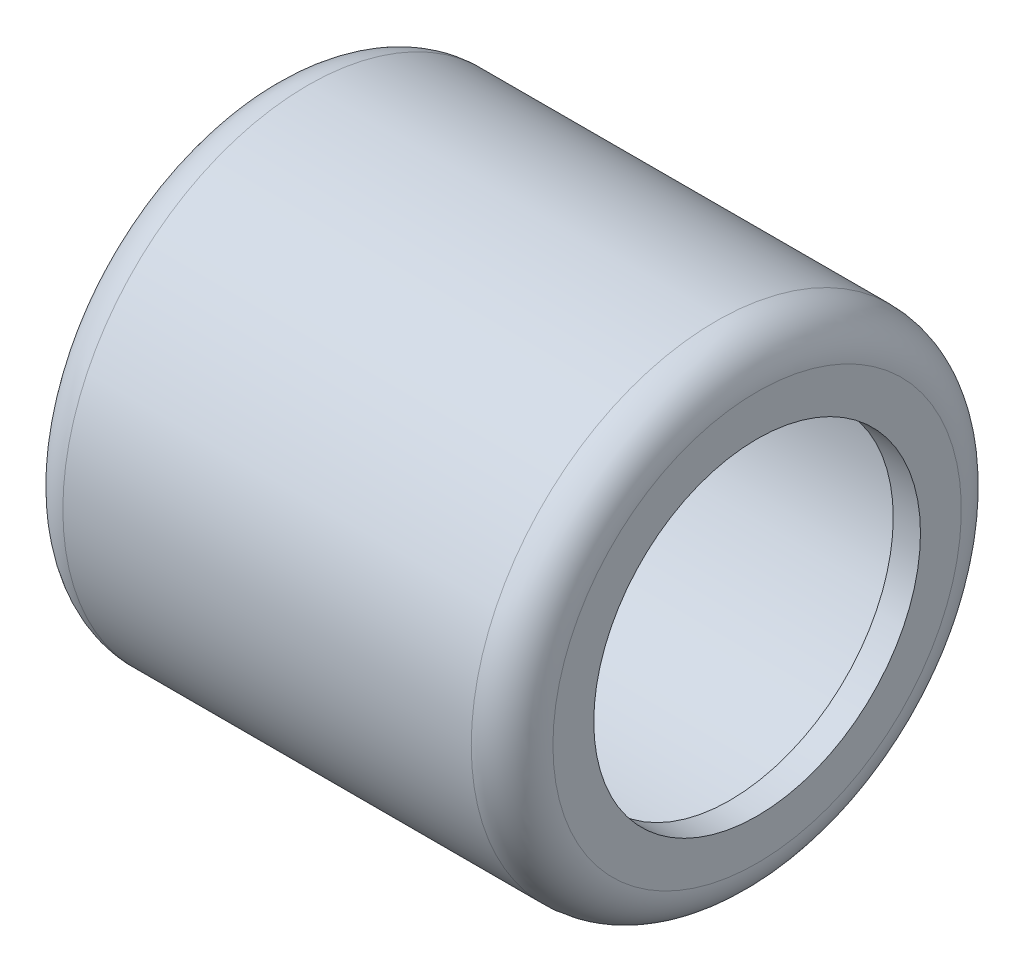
ISO-10303-21;
HEADER;
FILE_DESCRIPTION(('STEP AP214'),'2;1');
FILE_NAME('part.step','',(''),(''),'','','');
FILE_SCHEMA(('AUTOMOTIVE_DESIGN { 1 0 10303 214 1 1 1 1 }'));
ENDSEC;
DATA;
#1=APPLICATION_CONTEXT('core data for automotive mechanical design processes');
#2=APPLICATION_PROTOCOL_DEFINITION('international standard','automotive_design',2000,#1);
#3=PRODUCT_CONTEXT('',#1,'mechanical');
#4=PRODUCT('Part','Part','',(#3));
#5=PRODUCT_RELATED_PRODUCT_CATEGORY('part','',(#4));
#6=PRODUCT_DEFINITION_FORMATION('','',#4);
#7=PRODUCT_DEFINITION_CONTEXT('part definition',#1,'design');
#8=PRODUCT_DEFINITION('design','',#6,#7);
#9=PRODUCT_DEFINITION_SHAPE('','',#8);
#10=(LENGTH_UNIT() NAMED_UNIT(*) SI_UNIT(.MILLI.,.METRE.));
#11=(NAMED_UNIT(*) PLANE_ANGLE_UNIT() SI_UNIT($,.RADIAN.));
#12=(NAMED_UNIT(*) SI_UNIT($,.STERADIAN.) SOLID_ANGLE_UNIT());
#13=UNCERTAINTY_MEASURE_WITH_UNIT(LENGTH_MEASURE(1.E-05),#10,'distance_accuracy_value','');
#14=(GEOMETRIC_REPRESENTATION_CONTEXT(3) GLOBAL_UNCERTAINTY_ASSIGNED_CONTEXT((#13)) GLOBAL_UNIT_ASSIGNED_CONTEXT((#10,
#11,#12)) REPRESENTATION_CONTEXT('',''));
#15=CARTESIAN_POINT('',(0.,0.,0.));
#16=DIRECTION('',(0.,0.,1.));
#17=DIRECTION('',(1.,0.,0.));
#18=AXIS2_PLACEMENT_3D('',#15,#16,#17);
#19=CARTESIAN_POINT('',(0.,0.,0.));
#20=DIRECTION('',(-1.,0.,0.));
#21=DIRECTION('',(0.,0.,1.));
#22=AXIS2_PLACEMENT_3D('',#19,#20,#21);
#23=CYLINDRICAL_SURFACE('',#22,3.);
#24=CARTESIAN_POINT('',(4.5,0.,0.));
#25=DIRECTION('',(-1.,0.,0.));
#26=DIRECTION('',(0.,0.,1.));
#27=AXIS2_PLACEMENT_3D('',#24,#25,#26);
#28=CIRCLE('',#27,3.);
#29=CARTESIAN_POINT('',(4.5,0.,3.));
#30=VERTEX_POINT('',#29);
#31=EDGE_CURVE('E70',#30,#30,#28,.T.);
#32=ORIENTED_EDGE('',*,*,#31,.F.);
#33=EDGE_LOOP('',(#32));
#34=FACE_BOUND('',#33,.T.);
#35=CARTESIAN_POINT('',(4.,0.,0.));
#36=DIRECTION('',(-1.,0.,0.));
#37=DIRECTION('',(0.,0.,1.));
#38=AXIS2_PLACEMENT_3D('',#35,#36,#37);
#39=CIRCLE('',#38,3.);
#40=CARTESIAN_POINT('',(4.,0.,3.));
#41=VERTEX_POINT('',#40);
#42=EDGE_CURVE('E61',#41,#41,#39,.T.);
#43=ORIENTED_EDGE('',*,*,#42,.T.);
#44=EDGE_LOOP('',(#43));
#45=FACE_BOUND('',#44,.T.);
#46=ADVANCED_FACE('F30',(#34,#45),#23,.F.);
#47=CARTESIAN_POINT('',(4.,0.,-3.));
#48=DIRECTION('',(1.,0.,0.));
#49=DIRECTION('',(0.,0.,-1.));
#50=AXIS2_PLACEMENT_3D('',#47,#48,#49);
#51=PLANE('',#50);
#52=CARTESIAN_POINT('',(4.,0.,0.));
#53=DIRECTION('',(1.,0.,0.));
#54=DIRECTION('',(0.,0.,-1.));
#55=AXIS2_PLACEMENT_3D('',#52,#53,#54);
#56=CIRCLE('',#55,3.75);
#57=CARTESIAN_POINT('',(4.,0.,-3.75));
#58=VERTEX_POINT('',#57);
#59=EDGE_CURVE('E10',#58,#58,#56,.F.);
#60=ORIENTED_EDGE('',*,*,#59,.T.);
#61=EDGE_LOOP('',(#60));
#62=FACE_BOUND('',#61,.T.);
#63=ORIENTED_EDGE('',*,*,#42,.F.);
#64=EDGE_LOOP('',(#63));
#65=FACE_BOUND('',#64,.T.);
#66=ADVANCED_FACE('F78',(#62,#65),#51,.F.);
#67=CARTESIAN_POINT('',(0.,0.,0.));
#68=DIRECTION('',(-1.,0.,0.));
#69=DIRECTION('',(0.,0.,1.));
#70=AXIS2_PLACEMENT_3D('',#67,#68,#69);
#71=CYLINDRICAL_SURFACE('',#70,4.);
#72=CARTESIAN_POINT('',(-3.75,0.,0.));
#73=DIRECTION('',(-1.,0.,0.));
#74=DIRECTION('',(0.,0.,1.));
#75=AXIS2_PLACEMENT_3D('',#72,#73,#74);
#76=CIRCLE('',#75,4.);
#77=CARTESIAN_POINT('',(-3.75,0.,4.));
#78=VERTEX_POINT('',#77);
#79=EDGE_CURVE('E40',#78,#78,#76,.T.);
#80=ORIENTED_EDGE('',*,*,#79,.T.);
#81=EDGE_LOOP('',(#80));
#82=FACE_BOUND('',#81,.T.);
#83=CARTESIAN_POINT('',(3.75,0.,0.));
#84=DIRECTION('',(1.,0.,0.));
#85=DIRECTION('',(0.,0.,-1.));
#86=AXIS2_PLACEMENT_3D('',#83,#84,#85);
#87=CIRCLE('',#86,4.);
#88=CARTESIAN_POINT('',(3.75,0.,-4.));
#89=VERTEX_POINT('',#88);
#90=EDGE_CURVE('E44',#89,#89,#87,.T.);
#91=ORIENTED_EDGE('',*,*,#90,.T.);
#92=EDGE_LOOP('',(#91));
#93=FACE_BOUND('',#92,.T.);
#94=ADVANCED_FACE('F82',(#82,#93),#71,.F.);
#95=CARTESIAN_POINT('',(-4.,0.,-3.));
#96=DIRECTION('',(-1.,0.,0.));
#97=DIRECTION('',(0.,0.,1.));
#98=AXIS2_PLACEMENT_3D('',#95,#96,#97);
#99=PLANE('',#98);
#100=CARTESIAN_POINT('',(-4.,0.,0.));
#101=DIRECTION('',(-1.,0.,0.));
#102=DIRECTION('',(0.,0.,1.));
#103=AXIS2_PLACEMENT_3D('',#100,#101,#102);
#104=CIRCLE('',#103,3.75);
#105=CARTESIAN_POINT('',(-4.,0.,3.75));
#106=VERTEX_POINT('',#105);
#107=EDGE_CURVE('E36',#106,#106,#104,.F.);
#108=ORIENTED_EDGE('',*,*,#107,.T.);
#109=EDGE_LOOP('',(#108));
#110=FACE_BOUND('',#109,.T.);
#111=CARTESIAN_POINT('',(-4.,0.,0.));
#112=DIRECTION('',(-1.,0.,0.));
#113=DIRECTION('',(0.,0.,1.));
#114=AXIS2_PLACEMENT_3D('',#111,#112,#113);
#115=CIRCLE('',#114,3.);
#116=CARTESIAN_POINT('',(-4.,0.,3.));
#117=VERTEX_POINT('',#116);
#118=EDGE_CURVE('E64',#117,#117,#115,.T.);
#119=ORIENTED_EDGE('',*,*,#118,.T.);
#120=EDGE_LOOP('',(#119));
#121=FACE_BOUND('',#120,.T.);
#122=ADVANCED_FACE('F86',(#110,#121),#99,.F.);
#123=CARTESIAN_POINT('',(0.,0.,0.));
#124=DIRECTION('',(-1.,0.,0.));
#125=DIRECTION('',(0.,0.,1.));
#126=AXIS2_PLACEMENT_3D('',#123,#124,#125);
#127=CYLINDRICAL_SURFACE('',#126,3.);
#128=ORIENTED_EDGE('',*,*,#118,.F.);
#129=EDGE_LOOP('',(#128));
#130=FACE_BOUND('',#129,.T.);
#131=CARTESIAN_POINT('',(-4.5,0.,0.));
#132=DIRECTION('',(-1.,0.,0.));
#133=DIRECTION('',(0.,0.,1.));
#134=AXIS2_PLACEMENT_3D('',#131,#132,#133);
#135=CIRCLE('',#134,3.);
#136=CARTESIAN_POINT('',(-4.5,0.,3.));
#137=VERTEX_POINT('',#136);
#138=EDGE_CURVE('E67',#137,#137,#135,.T.);
#139=ORIENTED_EDGE('',*,*,#138,.T.);
#140=EDGE_LOOP('',(#139));
#141=FACE_BOUND('',#140,.T.);
#142=ADVANCED_FACE('F92',(#130,#141),#127,.F.);
#143=CARTESIAN_POINT('',(-4.5,0.,-4.5));
#144=DIRECTION('',(1.,0.,0.));
#145=DIRECTION('',(0.,0.,-1.));
#146=AXIS2_PLACEMENT_3D('',#143,#144,#145);
#147=PLANE('',#146);
#148=CARTESIAN_POINT('',(-4.5,0.,0.));
#149=DIRECTION('',(1.,0.,0.));
#150=DIRECTION('',(0.,0.,-1.));
#151=AXIS2_PLACEMENT_3D('',#148,#149,#150);
#152=CIRCLE('',#151,3.75);
#153=CARTESIAN_POINT('',(-4.5,0.,-3.75));
#154=VERTEX_POINT('',#153);
#155=EDGE_CURVE('E49',#154,#154,#152,.F.);
#156=ORIENTED_EDGE('',*,*,#155,.T.);
#157=EDGE_LOOP('',(#156));
#158=FACE_BOUND('',#157,.T.);
#159=ORIENTED_EDGE('',*,*,#138,.F.);
#160=EDGE_LOOP('',(#159));
#161=FACE_BOUND('',#160,.T.);
#162=ADVANCED_FACE('F95',(#158,#161),#147,.F.);
#163=CARTESIAN_POINT('',(0.,0.,0.));
#164=DIRECTION('',(-1.,0.,0.));
#165=DIRECTION('',(0.,0.,1.));
#166=AXIS2_PLACEMENT_3D('',#163,#164,#165);
#167=CYLINDRICAL_SURFACE('',#166,4.5);
#168=CARTESIAN_POINT('',(3.75,0.,0.));
#169=DIRECTION('',(-1.,0.,0.));
#170=DIRECTION('',(0.,0.,1.));
#171=AXIS2_PLACEMENT_3D('',#168,#169,#170);
#172=CIRCLE('',#171,4.5);
#173=CARTESIAN_POINT('',(3.75,0.,4.5));
#174=VERTEX_POINT('',#173);
#175=EDGE_CURVE('E55',#174,#174,#172,.T.);
#176=ORIENTED_EDGE('',*,*,#175,.T.);
#177=EDGE_LOOP('',(#176));
#178=FACE_BOUND('',#177,.T.);
#179=CARTESIAN_POINT('',(-3.75,0.,0.));
#180=DIRECTION('',(1.,0.,0.));
#181=DIRECTION('',(0.,0.,-1.));
#182=AXIS2_PLACEMENT_3D('',#179,#180,#181);
#183=CIRCLE('',#182,4.5);
#184=CARTESIAN_POINT('',(-3.75,0.,-4.5));
#185=VERTEX_POINT('',#184);
#186=EDGE_CURVE('E58',#185,#185,#183,.T.);
#187=ORIENTED_EDGE('',*,*,#186,.T.);
#188=EDGE_LOOP('',(#187));
#189=FACE_BOUND('',#188,.T.);
#190=ADVANCED_FACE('F99',(#178,#189),#167,.T.);
#191=CARTESIAN_POINT('',(4.5,0.,-4.5));
#192=DIRECTION('',(-1.,0.,0.));
#193=DIRECTION('',(0.,0.,1.));
#194=AXIS2_PLACEMENT_3D('',#191,#192,#193);
#195=PLANE('',#194);
#196=CARTESIAN_POINT('',(4.5,0.,0.));
#197=DIRECTION('',(-1.,0.,0.));
#198=DIRECTION('',(0.,0.,1.));
#199=AXIS2_PLACEMENT_3D('',#196,#197,#198);
#200=CIRCLE('',#199,3.75);
#201=CARTESIAN_POINT('',(4.5,0.,3.75));
#202=VERTEX_POINT('',#201);
#203=EDGE_CURVE('E52',#202,#202,#200,.F.);
#204=ORIENTED_EDGE('',*,*,#203,.T.);
#205=EDGE_LOOP('',(#204));
#206=FACE_BOUND('',#205,.T.);
#207=ORIENTED_EDGE('',*,*,#31,.T.);
#208=EDGE_LOOP('',(#207));
#209=FACE_BOUND('',#208,.T.);
#210=ADVANCED_FACE('F74',(#206,#209),#195,.F.);
#211=CARTESIAN_POINT('',(3.75,0.,0.));
#212=DIRECTION('',(-1.,0.,0.));
#213=DIRECTION('',(0.,0.,1.));
#214=AXIS2_PLACEMENT_3D('',#211,#212,#213);
#215=TOROIDAL_SURFACE('',#214,3.75,0.75);
#216=ORIENTED_EDGE('',*,*,#203,.F.);
#217=EDGE_LOOP('',(#216));
#218=FACE_BOUND('',#217,.T.);
#219=ORIENTED_EDGE('',*,*,#175,.F.);
#220=EDGE_LOOP('',(#219));
#221=FACE_BOUND('',#220,.T.);
#222=ADVANCED_FACE('F106',(#218,#221),#215,.T.);
#223=CARTESIAN_POINT('',(-3.75,0.,0.));
#224=DIRECTION('',(1.,0.,0.));
#225=DIRECTION('',(0.,0.,-1.));
#226=AXIS2_PLACEMENT_3D('',#223,#224,#225);
#227=TOROIDAL_SURFACE('',#226,3.75,0.75);
#228=ORIENTED_EDGE('',*,*,#186,.F.);
#229=EDGE_LOOP('',(#228));
#230=FACE_BOUND('',#229,.T.);
#231=ORIENTED_EDGE('',*,*,#155,.F.);
#232=EDGE_LOOP('',(#231));
#233=FACE_BOUND('',#232,.T.);
#234=ADVANCED_FACE('F110',(#230,#233),#227,.T.);
#235=CARTESIAN_POINT('',(-3.75,0.,0.));
#236=DIRECTION('',(-1.,0.,0.));
#237=DIRECTION('',(0.,0.,1.));
#238=AXIS2_PLACEMENT_3D('',#235,#236,#237);
#239=TOROIDAL_SURFACE('',#238,3.75,0.25);
#240=ORIENTED_EDGE('',*,*,#107,.F.);
#241=EDGE_LOOP('',(#240));
#242=FACE_BOUND('',#241,.T.);
#243=ORIENTED_EDGE('',*,*,#79,.F.);
#244=EDGE_LOOP('',(#243));
#245=FACE_BOUND('',#244,.T.);
#246=ADVANCED_FACE('F114',(#242,#245),#239,.F.);
#247=CARTESIAN_POINT('',(3.75,0.,0.));
#248=DIRECTION('',(1.,0.,0.));
#249=DIRECTION('',(0.,0.,-1.));
#250=AXIS2_PLACEMENT_3D('',#247,#248,#249);
#251=TOROIDAL_SURFACE('',#250,3.75,0.25);
#252=ORIENTED_EDGE('',*,*,#90,.F.);
#253=EDGE_LOOP('',(#252));
#254=FACE_BOUND('',#253,.T.);
#255=ORIENTED_EDGE('',*,*,#59,.F.);
#256=EDGE_LOOP('',(#255));
#257=FACE_BOUND('',#256,.T.);
#258=ADVANCED_FACE('F118',(#254,#257),#251,.F.);
#259=CLOSED_SHELL('',(#46,#66,#94,#122,#142,#162,#190,#210,#222,#234,#246,#258));
#260=MANIFOLD_SOLID_BREP('B2',#259);
#261=ADVANCED_BREP_SHAPE_REPRESENTATION('',(#18,#260),#14);
#262=SHAPE_DEFINITION_REPRESENTATION(#9,#261);
ENDSEC;
END-ISO-10303-21;
